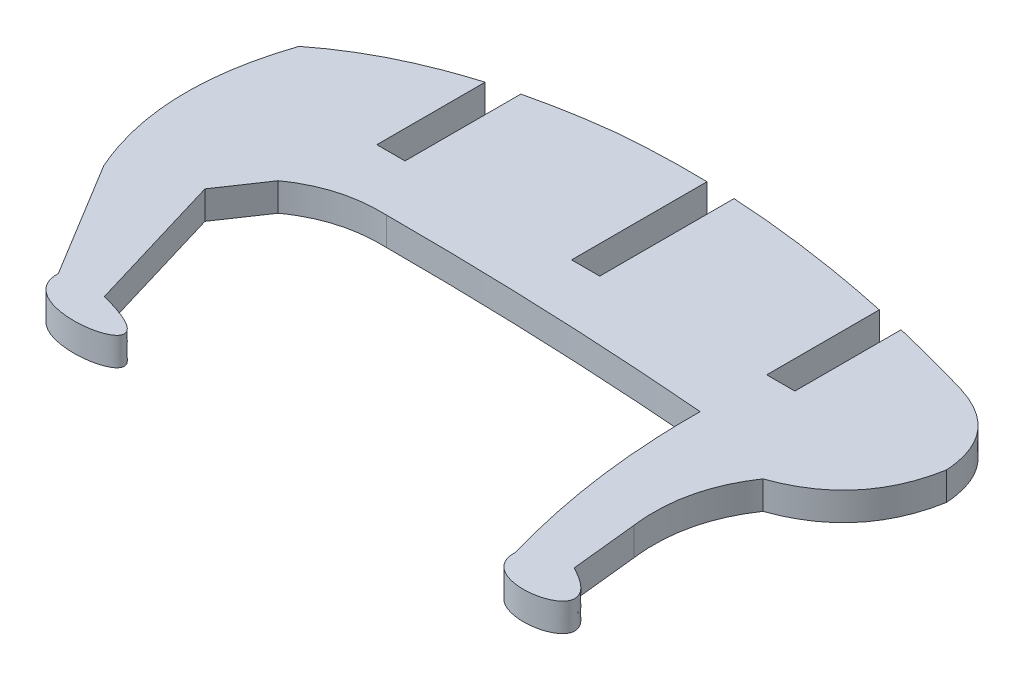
ISO-10303-21;
HEADER;
FILE_DESCRIPTION(('STEP AP214'),'2;1');
FILE_NAME('part.step','',(''),(''),'','','');
FILE_SCHEMA(('AUTOMOTIVE_DESIGN { 1 0 10303 214 1 1 1 1 }'));
ENDSEC;
DATA;
#1=APPLICATION_CONTEXT('core data for automotive mechanical design processes');
#2=APPLICATION_PROTOCOL_DEFINITION('international standard','automotive_design',2000,#1);
#3=PRODUCT_CONTEXT('',#1,'mechanical');
#4=PRODUCT('Part','Part','',(#3));
#5=PRODUCT_RELATED_PRODUCT_CATEGORY('part','',(#4));
#6=PRODUCT_DEFINITION_FORMATION('','',#4);
#7=PRODUCT_DEFINITION_CONTEXT('part definition',#1,'design');
#8=PRODUCT_DEFINITION('design','',#6,#7);
#9=PRODUCT_DEFINITION_SHAPE('','',#8);
#10=(LENGTH_UNIT() NAMED_UNIT(*) SI_UNIT(.MILLI.,.METRE.));
#11=(NAMED_UNIT(*) PLANE_ANGLE_UNIT() SI_UNIT($,.RADIAN.));
#12=(NAMED_UNIT(*) SI_UNIT($,.STERADIAN.) SOLID_ANGLE_UNIT());
#13=UNCERTAINTY_MEASURE_WITH_UNIT(LENGTH_MEASURE(1.E-05),#10,'distance_accuracy_value','');
#14=(GEOMETRIC_REPRESENTATION_CONTEXT(3) GLOBAL_UNCERTAINTY_ASSIGNED_CONTEXT((#13)) GLOBAL_UNIT_ASSIGNED_CONTEXT((#10,
#11,#12)) REPRESENTATION_CONTEXT('',''));
#15=CARTESIAN_POINT('',(0.,0.,0.));
#16=DIRECTION('',(0.,0.,1.));
#17=DIRECTION('',(1.,0.,0.));
#18=AXIS2_PLACEMENT_3D('',#15,#16,#17);
#19=CARTESIAN_POINT('',(48.337885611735,3.,-21.7938698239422));
#20=CARTESIAN_POINT('',(54.6502540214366,3.,-19.8548808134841));
#21=CARTESIAN_POINT('',(55.0566484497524,3.,-13.5654188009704));
#22=B_SPLINE_CURVE_WITH_KNOTS('',2,(#19,#20,#21),.UNSPECIFIED.,.F.,.F.,(3,3),(0.,1.),.UNSPECIFIED.);
#23=DIRECTION('',(0.,-1.,0.));
#24=VECTOR('',#23,1.);
#25=SURFACE_OF_LINEAR_EXTRUSION('',#22,#24);
#26=CARTESIAN_POINT('',(48.337885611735,0.,-21.7938698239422));
#27=CARTESIAN_POINT('',(54.6502540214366,0.,-19.8548808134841));
#28=CARTESIAN_POINT('',(55.0566484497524,0.,-13.5654188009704));
#29=B_SPLINE_CURVE_WITH_KNOTS('',2,(#26,#27,#28),.UNSPECIFIED.,.F.,.F.,(3,3),(0.,1.),.UNSPECIFIED.);
#30=CARTESIAN_POINT('',(48.337885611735,0.,-21.7938698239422));
#31=VERTEX_POINT('',#30);
#32=CARTESIAN_POINT('',(55.0566484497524,0.,-13.5654188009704));
#33=VERTEX_POINT('',#32);
#34=EDGE_CURVE('E254',#31,#33,#29,.T.);
#35=ORIENTED_EDGE('',*,*,#34,.F.);
#36=DIRECTION('',(0.,-1.,0.));
#37=VECTOR('',#36,1.);
#38=CARTESIAN_POINT('',(48.337885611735,3.,-21.7938698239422));
#39=LINE('',#38,#37);
#40=CARTESIAN_POINT('',(48.337885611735,3.,-21.7938698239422));
#41=VERTEX_POINT('',#40);
#42=EDGE_CURVE('E11',#41,#31,#39,.T.);
#43=ORIENTED_EDGE('',*,*,#42,.F.);
#44=CARTESIAN_POINT('',(55.0566484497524,3.,-13.5654188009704));
#45=VERTEX_POINT('',#44);
#46=EDGE_CURVE('E420',#41,#45,#22,.T.);
#47=ORIENTED_EDGE('',*,*,#46,.T.);
#48=DIRECTION('',(0.,-1.,0.));
#49=VECTOR('',#48,1.);
#50=CARTESIAN_POINT('',(55.0566484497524,3.,-13.5654188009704));
#51=LINE('',#50,#49);
#52=EDGE_CURVE('E43',#45,#33,#51,.T.);
#53=ORIENTED_EDGE('',*,*,#52,.T.);
#54=EDGE_LOOP('',(#35,#43,#47,#53));
#55=FACE_BOUND('',#54,.T.);
#56=ADVANCED_FACE('F39',(#55),#25,.T.);
#57=CARTESIAN_POINT('',(39.7065995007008,3.,-24.0872112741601));
#58=CARTESIAN_POINT('',(43.9230674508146,3.,-23.089505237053));
#59=CARTESIAN_POINT('',(48.337885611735,3.,-21.7938698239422));
#60=B_SPLINE_CURVE_WITH_KNOTS('',2,(#57,#58,#59),.UNSPECIFIED.,.F.,.F.,(3,3),(0.888901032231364,
1.),.UNSPECIFIED.);
#61=DIRECTION('',(0.,-1.,0.));
#62=VECTOR('',#61,1.);
#63=SURFACE_OF_LINEAR_EXTRUSION('',#60,#62);
#64=CARTESIAN_POINT('',(39.7065995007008,0.,-24.0872112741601));
#65=CARTESIAN_POINT('',(43.9230674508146,0.,-23.089505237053));
#66=CARTESIAN_POINT('',(48.337885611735,0.,-21.7938698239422));
#67=B_SPLINE_CURVE_WITH_KNOTS('',2,(#64,#65,#66),.UNSPECIFIED.,.F.,.F.,(3,3),(0.888901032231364,
1.),.UNSPECIFIED.);
#68=CARTESIAN_POINT('',(39.7065995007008,0.,-24.0872112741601));
#69=VERTEX_POINT('',#68);
#70=EDGE_CURVE('E427',#69,#31,#67,.T.);
#71=ORIENTED_EDGE('',*,*,#70,.F.);
#72=DIRECTION('',(0.,-1.,0.));
#73=VECTOR('',#72,1.);
#74=CARTESIAN_POINT('',(39.7065995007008,3.,-24.0872112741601));
#75=LINE('',#74,#73);
#76=CARTESIAN_POINT('',(39.7065995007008,3.,-24.0872112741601));
#77=VERTEX_POINT('',#76);
#78=EDGE_CURVE('E49',#77,#69,#75,.T.);
#79=ORIENTED_EDGE('',*,*,#78,.F.);
#80=EDGE_CURVE('E233',#77,#41,#60,.T.);
#81=ORIENTED_EDGE('',*,*,#80,.T.);
#82=ORIENTED_EDGE('',*,*,#42,.T.);
#83=EDGE_LOOP('',(#71,#79,#81,#82));
#84=FACE_BOUND('',#83,.T.);
#85=ADVANCED_FACE('F262',(#84),#63,.T.);
#86=CARTESIAN_POINT('',(39.7065995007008,3.,-24.0872112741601));
#87=DIRECTION('',(1.,0.,0.));
#88=DIRECTION('',(0.,0.,-1.));
#89=AXIS2_PLACEMENT_3D('',#86,#87,#88);
#90=PLANE('',#89);
#91=DIRECTION('',(0.,0.,1.));
#92=VECTOR('',#91,1.);
#93=CARTESIAN_POINT('',(39.7065995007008,0.,-24.0872112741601));
#94=LINE('',#93,#92);
#95=CARTESIAN_POINT('',(39.7065995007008,0.,-12.767457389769));
#96=VERTEX_POINT('',#95);
#97=EDGE_CURVE('E237',#69,#96,#94,.T.);
#98=ORIENTED_EDGE('',*,*,#97,.T.);
#99=DIRECTION('',(0.,-1.,0.));
#100=VECTOR('',#99,1.);
#101=CARTESIAN_POINT('',(39.7065995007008,3.,-12.767457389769));
#102=LINE('',#101,#100);
#103=CARTESIAN_POINT('',(39.7065995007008,3.,-12.767457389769));
#104=VERTEX_POINT('',#103);
#105=EDGE_CURVE('E235',#104,#96,#102,.T.);
#106=ORIENTED_EDGE('',*,*,#105,.F.);
#107=DIRECTION('',(0.,0.,1.));
#108=VECTOR('',#107,1.);
#109=CARTESIAN_POINT('',(39.7065995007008,3.,-24.0872112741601));
#110=LINE('',#109,#108);
#111=EDGE_CURVE('E226',#77,#104,#110,.T.);
#112=ORIENTED_EDGE('',*,*,#111,.F.);
#113=ORIENTED_EDGE('',*,*,#78,.T.);
#114=EDGE_LOOP('',(#98,#106,#112,#113));
#115=FACE_BOUND('',#114,.T.);
#116=ADVANCED_FACE('F236',(#115),#90,.F.);
#117=CARTESIAN_POINT('',(36.7065995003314,3.,-12.767457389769));
#118=DIRECTION('',(0.,0.,-1.));
#119=DIRECTION('',(-1.,0.,0.));
#120=AXIS2_PLACEMENT_3D('',#117,#118,#119);
#121=PLANE('',#120);
#122=DIRECTION('',(1.,0.,0.));
#123=VECTOR('',#122,1.);
#124=CARTESIAN_POINT('',(36.7065995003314,0.,-12.767457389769));
#125=LINE('',#124,#123);
#126=CARTESIAN_POINT('',(36.7065995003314,0.,-12.767457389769));
#127=VERTEX_POINT('',#126);
#128=EDGE_CURVE('E430',#127,#96,#125,.T.);
#129=ORIENTED_EDGE('',*,*,#128,.F.);
#130=DIRECTION('',(0.,-1.,0.));
#131=VECTOR('',#130,1.);
#132=CARTESIAN_POINT('',(36.7065995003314,3.,-12.767457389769));
#133=LINE('',#132,#131);
#134=CARTESIAN_POINT('',(36.7065995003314,3.,-12.767457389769));
#135=VERTEX_POINT('',#134);
#136=EDGE_CURVE('E241',#135,#127,#133,.T.);
#137=ORIENTED_EDGE('',*,*,#136,.F.);
#138=DIRECTION('',(1.,0.,0.));
#139=VECTOR('',#138,1.);
#140=CARTESIAN_POINT('',(36.7065995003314,3.,-12.767457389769));
#141=LINE('',#140,#139);
#142=EDGE_CURVE('E231',#135,#104,#141,.T.);
#143=ORIENTED_EDGE('',*,*,#142,.T.);
#144=ORIENTED_EDGE('',*,*,#105,.T.);
#145=EDGE_LOOP('',(#129,#137,#143,#144));
#146=FACE_BOUND('',#145,.T.);
#147=ADVANCED_FACE('F243',(#146),#121,.T.);
#148=CARTESIAN_POINT('',(36.7065995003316,3.,-24.7647669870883));
#149=DIRECTION('',(1.,0.,0.));
#150=DIRECTION('',(0.,0.,-1.));
#151=AXIS2_PLACEMENT_3D('',#148,#149,#150);
#152=PLANE('',#151);
#153=DIRECTION('',(0.,0.,1.));
#154=VECTOR('',#153,1.);
#155=CARTESIAN_POINT('',(36.7065995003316,0.,-24.7647669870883));
#156=LINE('',#155,#154);
#157=CARTESIAN_POINT('',(36.7065995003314,0.,-24.7647669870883));
#158=VERTEX_POINT('',#157);
#159=EDGE_CURVE('E472',#158,#127,#156,.T.);
#160=ORIENTED_EDGE('',*,*,#159,.F.);
#161=DIRECTION('',(0.,-1.,0.));
#162=VECTOR('',#161,1.);
#163=CARTESIAN_POINT('',(36.7065995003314,3.,-24.7647669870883));
#164=LINE('',#163,#162);
#165=CARTESIAN_POINT('',(36.7065995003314,3.,-24.7647669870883));
#166=VERTEX_POINT('',#165);
#167=EDGE_CURVE('E441',#166,#158,#164,.T.);
#168=ORIENTED_EDGE('',*,*,#167,.F.);
#169=DIRECTION('',(0.,0.,1.));
#170=VECTOR('',#169,1.);
#171=CARTESIAN_POINT('',(36.7065995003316,3.,-24.7647669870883));
#172=LINE('',#171,#170);
#173=EDGE_CURVE('E244',#166,#135,#172,.T.);
#174=ORIENTED_EDGE('',*,*,#173,.T.);
#175=ORIENTED_EDGE('',*,*,#136,.T.);
#176=EDGE_LOOP('',(#160,#168,#174,#175));
#177=FACE_BOUND('',#176,.T.);
#178=ADVANCED_FACE('F272',(#177),#152,.T.);
#179=CARTESIAN_POINT('',(18.7065995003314,3.,-27.285407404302));
#180=CARTESIAN_POINT('',(24.3576299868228,3.,-26.969359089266));
#181=CARTESIAN_POINT('',(30.3576299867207,3.,-26.1291456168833));
#182=CARTESIAN_POINT('',(36.7065995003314,3.,-24.7647669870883));
#183=B_SPLINE_CURVE_WITH_KNOTS('',3,(#179,#180,#181,#182),.UNSPECIFIED.,.F.,.F.,(4,4),
(0.593801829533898,0.849041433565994),.UNSPECIFIED.);
#184=DIRECTION('',(0.,-1.,0.));
#185=VECTOR('',#184,1.);
#186=SURFACE_OF_LINEAR_EXTRUSION('',#183,#185);
#187=CARTESIAN_POINT('',(18.7065995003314,0.,-27.285407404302));
#188=CARTESIAN_POINT('',(24.3576299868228,0.,-26.969359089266));
#189=CARTESIAN_POINT('',(30.3576299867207,0.,-26.1291456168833));
#190=CARTESIAN_POINT('',(36.7065995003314,0.,-24.7647669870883));
#191=B_SPLINE_CURVE_WITH_KNOTS('',3,(#187,#188,#189,#190),.UNSPECIFIED.,.F.,.F.,(4,4),
(0.593801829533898,0.849041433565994),.UNSPECIFIED.);
#192=CARTESIAN_POINT('',(18.7065995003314,0.,-27.285407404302));
#193=VERTEX_POINT('',#192);
#194=EDGE_CURVE('E467',#193,#158,#191,.T.);
#195=ORIENTED_EDGE('',*,*,#194,.F.);
#196=DIRECTION('',(0.,-1.,0.));
#197=VECTOR('',#196,1.);
#198=CARTESIAN_POINT('',(18.7065995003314,3.,-27.285407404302));
#199=LINE('',#198,#197);
#200=CARTESIAN_POINT('',(18.7065995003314,3.,-27.285407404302));
#201=VERTEX_POINT('',#200);
#202=EDGE_CURVE('E443',#201,#193,#199,.T.);
#203=ORIENTED_EDGE('',*,*,#202,.F.);
#204=EDGE_CURVE('E246',#201,#166,#183,.T.);
#205=ORIENTED_EDGE('',*,*,#204,.T.);
#206=ORIENTED_EDGE('',*,*,#167,.T.);
#207=EDGE_LOOP('',(#195,#203,#205,#206));
#208=FACE_BOUND('',#207,.T.);
#209=ADVANCED_FACE('F275',(#208),#186,.T.);
#210=CARTESIAN_POINT('',(18.7065995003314,3.,-27.285407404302));
#211=DIRECTION('',(1.,0.,0.));
#212=DIRECTION('',(0.,0.,-1.));
#213=AXIS2_PLACEMENT_3D('',#210,#211,#212);
#214=PLANE('',#213);
#215=DIRECTION('',(0.,0.,1.));
#216=VECTOR('',#215,1.);
#217=CARTESIAN_POINT('',(18.7065995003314,0.,-27.285407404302));
#218=LINE('',#217,#216);
#219=CARTESIAN_POINT('',(18.7065995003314,0.,-12.978867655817));
#220=VERTEX_POINT('',#219);
#221=EDGE_CURVE('E457',#193,#220,#218,.T.);
#222=ORIENTED_EDGE('',*,*,#221,.T.);
#223=DIRECTION('',(0.,-1.,0.));
#224=VECTOR('',#223,1.);
#225=CARTESIAN_POINT('',(18.7065995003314,3.,-12.978867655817));
#226=LINE('',#225,#224);
#227=CARTESIAN_POINT('',(18.7065995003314,3.,-12.978867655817));
#228=VERTEX_POINT('',#227);
#229=EDGE_CURVE('E445',#228,#220,#226,.T.);
#230=ORIENTED_EDGE('',*,*,#229,.F.);
#231=DIRECTION('',(0.,0.,1.));
#232=VECTOR('',#231,1.);
#233=CARTESIAN_POINT('',(18.7065995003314,3.,-27.285407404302));
#234=LINE('',#233,#232);
#235=EDGE_CURVE('E287',#201,#228,#234,.T.);
#236=ORIENTED_EDGE('',*,*,#235,.F.);
#237=ORIENTED_EDGE('',*,*,#202,.T.);
#238=EDGE_LOOP('',(#222,#230,#236,#237));
#239=FACE_BOUND('',#238,.T.);
#240=ADVANCED_FACE('F279',(#239),#214,.F.);
#241=CARTESIAN_POINT('',(15.7065994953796,3.,-12.978867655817));
#242=DIRECTION('',(0.,0.,-1.));
#243=DIRECTION('',(-1.,0.,0.));
#244=AXIS2_PLACEMENT_3D('',#241,#242,#243);
#245=PLANE('',#244);
#246=DIRECTION('',(1.,0.,0.));
#247=VECTOR('',#246,1.);
#248=CARTESIAN_POINT('',(15.7065994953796,0.,-12.978867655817));
#249=LINE('',#248,#247);
#250=CARTESIAN_POINT('',(15.7065994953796,0.,-12.978867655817));
#251=VERTEX_POINT('',#250);
#252=EDGE_CURVE('E452',#251,#220,#249,.T.);
#253=ORIENTED_EDGE('',*,*,#252,.F.);
#254=DIRECTION('',(0.,-1.,0.));
#255=VECTOR('',#254,1.);
#256=CARTESIAN_POINT('',(15.7065994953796,3.,-12.978867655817));
#257=LINE('',#256,#255);
#258=CARTESIAN_POINT('',(15.7065994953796,3.,-12.978867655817));
#259=VERTEX_POINT('',#258);
#260=EDGE_CURVE('E381',#259,#251,#257,.T.);
#261=ORIENTED_EDGE('',*,*,#260,.F.);
#262=DIRECTION('',(1.,0.,0.));
#263=VECTOR('',#262,1.);
#264=CARTESIAN_POINT('',(15.7065994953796,3.,-12.978867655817));
#265=LINE('',#264,#263);
#266=EDGE_CURVE('E292',#259,#228,#265,.T.);
#267=ORIENTED_EDGE('',*,*,#266,.T.);
#268=ORIENTED_EDGE('',*,*,#229,.T.);
#269=EDGE_LOOP('',(#253,#261,#267,#268));
#270=FACE_BOUND('',#269,.T.);
#271=ADVANCED_FACE('F453',(#270),#245,.T.);
#272=CARTESIAN_POINT('',(15.7065994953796,3.,-27.4047164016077));
#273=DIRECTION('',(1.,0.,0.));
#274=DIRECTION('',(0.,0.,-1.));
#275=AXIS2_PLACEMENT_3D('',#272,#273,#274);
#276=PLANE('',#275);
#277=DIRECTION('',(0.,0.,1.));
#278=VECTOR('',#277,1.);
#279=CARTESIAN_POINT('',(15.7065994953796,0.,-27.4047164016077));
#280=LINE('',#279,#278);
#281=CARTESIAN_POINT('',(15.7065994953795,0.,-27.4047164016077));
#282=VERTEX_POINT('',#281);
#283=EDGE_CURVE('E449',#282,#251,#280,.T.);
#284=ORIENTED_EDGE('',*,*,#283,.F.);
#285=DIRECTION('',(0.,-1.,0.));
#286=VECTOR('',#285,1.);
#287=CARTESIAN_POINT('',(15.7065994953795,3.,-27.4047164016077));
#288=LINE('',#287,#286);
#289=CARTESIAN_POINT('',(15.7065994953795,3.,-27.4047164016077));
#290=VERTEX_POINT('',#289);
#291=EDGE_CURVE('E375',#290,#282,#288,.T.);
#292=ORIENTED_EDGE('',*,*,#291,.F.);
#293=DIRECTION('',(0.,0.,1.));
#294=VECTOR('',#293,1.);
#295=CARTESIAN_POINT('',(15.7065994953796,3.,-27.4047164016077));
#296=LINE('',#295,#294);
#297=EDGE_CURVE('E295',#290,#259,#296,.T.);
#298=ORIENTED_EDGE('',*,*,#297,.T.);
#299=ORIENTED_EDGE('',*,*,#260,.T.);
#300=EDGE_LOOP('',(#284,#292,#298,#299));
#301=FACE_BOUND('',#300,.T.);
#302=ADVANCED_FACE('F318',(#301),#276,.T.);
#303=CARTESIAN_POINT('',(6.23728601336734,3.,-27.0796653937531));
#304=CARTESIAN_POINT('',(9.2708349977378,3.,-27.3725993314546));
#305=CARTESIAN_POINT('',(12.4272728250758,3.,-27.4809496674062));
#306=CARTESIAN_POINT('',(15.7065994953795,3.,-27.4047164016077));
#307=B_SPLINE_CURVE_WITH_KNOTS('',3,(#303,#304,#305,#306),.UNSPECIFIED.,.F.,.F.,(4,4),
(0.396665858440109,0.548130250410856),.UNSPECIFIED.);
#308=DIRECTION('',(0.,-1.,0.));
#309=VECTOR('',#308,1.);
#310=SURFACE_OF_LINEAR_EXTRUSION('',#307,#309);
#311=CARTESIAN_POINT('',(6.23728601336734,0.,-27.0796653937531));
#312=CARTESIAN_POINT('',(9.2708349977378,0.,-27.3725993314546));
#313=CARTESIAN_POINT('',(12.4272728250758,0.,-27.4809496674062));
#314=CARTESIAN_POINT('',(15.7065994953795,0.,-27.4047164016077));
#315=B_SPLINE_CURVE_WITH_KNOTS('',3,(#311,#312,#313,#314),.UNSPECIFIED.,.F.,.F.,(4,4),
(0.396665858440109,0.548130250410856),.UNSPECIFIED.);
#316=CARTESIAN_POINT('',(6.23728601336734,0.,-27.0796653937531));
#317=VERTEX_POINT('',#316);
#318=EDGE_CURVE('E378',#317,#282,#315,.T.);
#319=ORIENTED_EDGE('',*,*,#318,.F.);
#320=DIRECTION('',(0.,-1.,0.));
#321=VECTOR('',#320,1.);
#322=CARTESIAN_POINT('',(6.23728601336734,3.,-27.0796653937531));
#323=LINE('',#322,#321);
#324=CARTESIAN_POINT('',(6.23728601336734,3.,-27.0796653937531));
#325=VERTEX_POINT('',#324);
#326=EDGE_CURVE('E369',#325,#317,#323,.T.);
#327=ORIENTED_EDGE('',*,*,#326,.F.);
#328=EDGE_CURVE('E298',#325,#290,#307,.T.);
#329=ORIENTED_EDGE('',*,*,#328,.T.);
#330=ORIENTED_EDGE('',*,*,#291,.T.);
#331=EDGE_LOOP('',(#319,#327,#329,#330));
#332=FACE_BOUND('',#331,.T.);
#333=ADVANCED_FACE('F313',(#332),#310,.T.);
#334=CARTESIAN_POINT('',(-2.29340050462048,3.,-25.5718308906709));
#335=CARTESIAN_POINT('',(1.93618210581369,3.,-26.5898860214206));
#336=CARTESIAN_POINT('',(6.23728601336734,3.,-27.0796653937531));
#337=B_SPLINE_CURVE_WITH_KNOTS('',2,(#334,#335,#336),.UNSPECIFIED.,.F.,.F.,(3,3),
(0.783562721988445,1.),.UNSPECIFIED.);
#338=DIRECTION('',(0.,-1.,0.));
#339=VECTOR('',#338,1.);
#340=SURFACE_OF_LINEAR_EXTRUSION('',#337,#339);
#341=CARTESIAN_POINT('',(-2.29340050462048,0.,-25.5718308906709));
#342=CARTESIAN_POINT('',(1.93618210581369,0.,-26.5898860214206));
#343=CARTESIAN_POINT('',(6.23728601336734,0.,-27.0796653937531));
#344=B_SPLINE_CURVE_WITH_KNOTS('',2,(#341,#342,#343),.UNSPECIFIED.,.F.,.F.,(3,3),
(0.783562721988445,1.),.UNSPECIFIED.);
#345=CARTESIAN_POINT('',(-2.29340050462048,0.,-25.5718308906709));
#346=VERTEX_POINT('',#345);
#347=EDGE_CURVE('E460',#346,#317,#344,.T.);
#348=ORIENTED_EDGE('',*,*,#347,.F.);
#349=DIRECTION('',(0.,-1.,0.));
#350=VECTOR('',#349,1.);
#351=CARTESIAN_POINT('',(-2.29340050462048,3.,-25.5718308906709));
#352=LINE('',#351,#350);
#353=CARTESIAN_POINT('',(-2.29340050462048,3.,-25.5718308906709));
#354=VERTEX_POINT('',#353);
#355=EDGE_CURVE('E371',#354,#346,#352,.T.);
#356=ORIENTED_EDGE('',*,*,#355,.F.);
#357=EDGE_CURVE('E304',#354,#325,#337,.T.);
#358=ORIENTED_EDGE('',*,*,#357,.T.);
#359=ORIENTED_EDGE('',*,*,#326,.T.);
#360=EDGE_LOOP('',(#348,#356,#358,#359));
#361=FACE_BOUND('',#360,.T.);
#362=ADVANCED_FACE('F317',(#361),#340,.T.);
#363=CARTESIAN_POINT('',(-2.29340050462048,3.,-25.5718308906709));
#364=DIRECTION('',(1.,0.,0.));
#365=DIRECTION('',(0.,0.,-1.));
#366=AXIS2_PLACEMENT_3D('',#363,#364,#365);
#367=PLANE('',#366);
#368=DIRECTION('',(0.,0.,1.));
#369=VECTOR('',#368,1.);
#370=CARTESIAN_POINT('',(-2.29340050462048,0.,-25.5718308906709));
#371=LINE('',#370,#369);
#372=CARTESIAN_POINT('',(-2.29340050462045,0.,-13.2320208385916));
#373=VERTEX_POINT('',#372);
#374=EDGE_CURVE('E895',#346,#373,#371,.T.);
#375=ORIENTED_EDGE('',*,*,#374,.T.);
#376=DIRECTION('',(0.,-1.,0.));
#377=VECTOR('',#376,1.);
#378=CARTESIAN_POINT('',(-2.29340050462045,3.,-13.2320208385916));
#379=LINE('',#378,#377);
#380=CARTESIAN_POINT('',(-2.29340050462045,3.,-13.2320208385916));
#381=VERTEX_POINT('',#380);
#382=EDGE_CURVE('E383',#381,#373,#379,.T.);
#383=ORIENTED_EDGE('',*,*,#382,.F.);
#384=DIRECTION('',(0.,0.,1.));
#385=VECTOR('',#384,1.);
#386=CARTESIAN_POINT('',(-2.29340050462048,3.,-25.5718308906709));
#387=LINE('',#386,#385);
#388=EDGE_CURVE('E362',#354,#381,#387,.T.);
#389=ORIENTED_EDGE('',*,*,#388,.F.);
#390=ORIENTED_EDGE('',*,*,#355,.T.);
#391=EDGE_LOOP('',(#375,#383,#389,#390));
#392=FACE_BOUND('',#391,.T.);
#393=ADVANCED_FACE('F322',(#392),#367,.F.);
#394=CARTESIAN_POINT('',(-5.29340051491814,3.,-13.2320208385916));
#395=DIRECTION('',(0.,0.,-1.));
#396=DIRECTION('',(-1.,0.,0.));
#397=AXIS2_PLACEMENT_3D('',#394,#395,#396);
#398=PLANE('',#397);
#399=DIRECTION('',(1.,0.,0.));
#400=VECTOR('',#399,1.);
#401=CARTESIAN_POINT('',(-5.29340051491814,0.,-13.2320208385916));
#402=LINE('',#401,#400);
#403=CARTESIAN_POINT('',(-5.29340051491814,0.,-13.2320208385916));
#404=VERTEX_POINT('',#403);
#405=EDGE_CURVE('E892',#404,#373,#402,.T.);
#406=ORIENTED_EDGE('',*,*,#405,.F.);
#407=DIRECTION('',(0.,-1.,0.));
#408=VECTOR('',#407,1.);
#409=CARTESIAN_POINT('',(-5.29340051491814,3.,-13.2320208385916));
#410=LINE('',#409,#408);
#411=CARTESIAN_POINT('',(-5.29340051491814,3.,-13.2320208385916));
#412=VERTEX_POINT('',#411);
#413=EDGE_CURVE('E388',#412,#404,#410,.T.);
#414=ORIENTED_EDGE('',*,*,#413,.F.);
#415=DIRECTION('',(1.,0.,0.));
#416=VECTOR('',#415,1.);
#417=CARTESIAN_POINT('',(-5.29340051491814,3.,-13.2320208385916));
#418=LINE('',#417,#416);
#419=EDGE_CURVE('E360',#412,#381,#418,.T.);
#420=ORIENTED_EDGE('',*,*,#419,.T.);
#421=ORIENTED_EDGE('',*,*,#382,.T.);
#422=EDGE_LOOP('',(#406,#414,#420,#421));
#423=FACE_BOUND('',#422,.T.);
#424=ADVANCED_FACE('F326',(#423),#398,.T.);
#425=CARTESIAN_POINT('',(-5.29340051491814,3.,-24.765059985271));
#426=DIRECTION('',(1.,0.,0.));
#427=DIRECTION('',(0.,0.,-1.));
#428=AXIS2_PLACEMENT_3D('',#425,#426,#427);
#429=PLANE('',#428);
#430=DIRECTION('',(0.,0.,1.));
#431=VECTOR('',#430,1.);
#432=CARTESIAN_POINT('',(-5.29340051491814,0.,-24.765059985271));
#433=LINE('',#432,#431);
#434=CARTESIAN_POINT('',(-5.29340051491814,0.,-24.765059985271));
#435=VERTEX_POINT('',#434);
#436=EDGE_CURVE('E886',#435,#404,#433,.T.);
#437=ORIENTED_EDGE('',*,*,#436,.F.);
#438=DIRECTION('',(0.,-1.,0.));
#439=VECTOR('',#438,1.);
#440=CARTESIAN_POINT('',(-5.29340051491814,3.,-24.765059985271));
#441=LINE('',#440,#439);
#442=CARTESIAN_POINT('',(-5.29340051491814,3.,-24.765059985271));
#443=VERTEX_POINT('',#442);
#444=EDGE_CURVE('E390',#443,#435,#441,.T.);
#445=ORIENTED_EDGE('',*,*,#444,.F.);
#446=DIRECTION('',(0.,0.,1.));
#447=VECTOR('',#446,1.);
#448=CARTESIAN_POINT('',(-5.29340051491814,3.,-24.765059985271));
#449=LINE('',#448,#447);
#450=EDGE_CURVE('E349',#443,#412,#449,.T.);
#451=ORIENTED_EDGE('',*,*,#450,.T.);
#452=ORIENTED_EDGE('',*,*,#413,.T.);
#453=EDGE_LOOP('',(#437,#445,#451,#452));
#454=FACE_BOUND('',#453,.T.);
#455=ADVANCED_FACE('F330',(#454),#429,.T.);
#456=CARTESIAN_POINT('',(-18.5169229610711,3.,-18.1507684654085));
#457=CARTESIAN_POINT('',(-16.029368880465,3.,-20.1251601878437));
#458=CARTESIAN_POINT('',(-11.7184028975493,3.,-22.5792570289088));
#459=CARTESIAN_POINT('',(-7.02427865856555,3.,-24.2475556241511));
#460=CARTESIAN_POINT('',(-5.29340051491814,3.,-24.765059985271));
#461=B_SPLINE_CURVE_WITH_KNOTS('',3,(#456,#457,#458,#459,#460),.UNSPECIFIED.,.F.,.F.,(4,1,4),
(0.333246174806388,0.571137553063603,0.706215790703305),.UNSPECIFIED.);
#462=DIRECTION('',(0.,-1.,0.));
#463=VECTOR('',#462,1.);
#464=SURFACE_OF_LINEAR_EXTRUSION('',#461,#463);
#465=CARTESIAN_POINT('',(-18.5169229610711,0.,-18.1507684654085));
#466=CARTESIAN_POINT('',(-16.029368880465,0.,-20.1251601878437));
#467=CARTESIAN_POINT('',(-11.7184028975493,0.,-22.5792570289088));
#468=CARTESIAN_POINT('',(-7.02427865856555,0.,-24.2475556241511));
#469=CARTESIAN_POINT('',(-5.29340051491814,0.,-24.765059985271));
#470=B_SPLINE_CURVE_WITH_KNOTS('',3,(#465,#466,#467,#468,#469),.UNSPECIFIED.,.F.,.F.,(4,1,4),
(0.333246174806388,0.571137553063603,0.706215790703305),.UNSPECIFIED.);
#471=CARTESIAN_POINT('',(-18.5169229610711,0.,-18.1507684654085));
#472=VERTEX_POINT('',#471);
#473=EDGE_CURVE('E878',#472,#435,#470,.T.);
#474=ORIENTED_EDGE('',*,*,#473,.F.);
#475=DIRECTION('',(0.,-1.,0.));
#476=VECTOR('',#475,1.);
#477=CARTESIAN_POINT('',(-18.5169229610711,3.,-18.1507684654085));
#478=LINE('',#477,#476);
#479=CARTESIAN_POINT('',(-18.5169229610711,3.,-18.1507684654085));
#480=VERTEX_POINT('',#479);
#481=EDGE_CURVE('E392',#480,#472,#478,.T.);
#482=ORIENTED_EDGE('',*,*,#481,.F.);
#483=EDGE_CURVE('E343',#480,#443,#461,.T.);
#484=ORIENTED_EDGE('',*,*,#483,.T.);
#485=ORIENTED_EDGE('',*,*,#444,.T.);
#486=EDGE_LOOP('',(#474,#482,#484,#485));
#487=FACE_BOUND('',#486,.T.);
#488=ADVANCED_FACE('F334',(#487),#464,.T.);
#489=CARTESIAN_POINT('',(-18.5169229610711,3.,-18.1507684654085));
#490=CARTESIAN_POINT('',(-22.3382391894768,3.,-6.7805902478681));
#491=CARTESIAN_POINT('',(-17.907658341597,3.,3.24395230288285));
#492=B_SPLINE_CURVE_WITH_KNOTS('',2,(#489,#490,#491),.UNSPECIFIED.,.F.,.F.,(3,3),(0.,1.),.UNSPECIFIED.);
#493=DIRECTION('',(0.,-1.,0.));
#494=VECTOR('',#493,1.);
#495=SURFACE_OF_LINEAR_EXTRUSION('',#492,#494);
#496=CARTESIAN_POINT('',(-18.5169229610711,0.,-18.1507684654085));
#497=CARTESIAN_POINT('',(-22.3382391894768,0.,-6.7805902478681));
#498=CARTESIAN_POINT('',(-17.907658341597,0.,3.24395230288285));
#499=B_SPLINE_CURVE_WITH_KNOTS('',2,(#496,#497,#498),.UNSPECIFIED.,.F.,.F.,(3,3),(0.,1.),.UNSPECIFIED.);
#500=CARTESIAN_POINT('',(-17.907658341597,0.,3.24395230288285));
#501=VERTEX_POINT('',#500);
#502=EDGE_CURVE('E784',#472,#501,#499,.T.);
#503=ORIENTED_EDGE('',*,*,#502,.T.);
#504=DIRECTION('',(0.,-1.,0.));
#505=VECTOR('',#504,1.);
#506=CARTESIAN_POINT('',(-17.907658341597,3.,3.24395230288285));
#507=LINE('',#506,#505);
#508=CARTESIAN_POINT('',(-17.907658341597,3.,3.24395230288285));
#509=VERTEX_POINT('',#508);
#510=EDGE_CURVE('E394',#509,#501,#507,.T.);
#511=ORIENTED_EDGE('',*,*,#510,.F.);
#512=EDGE_CURVE('E350',#480,#509,#492,.T.);
#513=ORIENTED_EDGE('',*,*,#512,.F.);
#514=ORIENTED_EDGE('',*,*,#481,.T.);
#515=EDGE_LOOP('',(#503,#511,#513,#514));
#516=FACE_BOUND('',#515,.T.);
#517=ADVANCED_FACE('F339',(#516),#495,.F.);
#518=CARTESIAN_POINT('',(-17.907658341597,3.,3.24395230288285));
#519=DIRECTION('',(0.854145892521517,0.,-0.520033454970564));
#520=DIRECTION('',(-0.520033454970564,0.,-0.854145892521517));
#521=AXIS2_PLACEMENT_3D('',#518,#519,#520);
#522=PLANE('',#521);
#523=CARTESIAN_POINT('',(-17.907658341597,0.,3.24395230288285));
#524=CARTESIAN_POINT('',(-10.3741587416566,0.,15.6175941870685));
#525=B_SPLINE_CURVE_WITH_KNOTS('',1,(#523,#524),.UNSPECIFIED.,.F.,.F.,(2,2),(0.,1.),.UNSPECIFIED.);
#526=CARTESIAN_POINT('',(-10.3741587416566,0.,15.6175941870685));
#527=VERTEX_POINT('',#526);
#528=EDGE_CURVE('E787',#501,#527,#525,.T.);
#529=ORIENTED_EDGE('',*,*,#528,.T.);
#530=DIRECTION('',(0.,-1.,0.));
#531=VECTOR('',#530,1.);
#532=CARTESIAN_POINT('',(-10.3741587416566,3.,15.6175941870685));
#533=LINE('',#532,#531);
#534=CARTESIAN_POINT('',(-10.3741587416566,3.,15.6175941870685));
#535=VERTEX_POINT('',#534);
#536=EDGE_CURVE('E397',#535,#527,#533,.T.);
#537=ORIENTED_EDGE('',*,*,#536,.F.);
#538=CARTESIAN_POINT('',(-17.907658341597,3.,3.24395230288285));
#539=CARTESIAN_POINT('',(-10.3741587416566,3.,15.6175941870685));
#540=B_SPLINE_CURVE_WITH_KNOTS('',1,(#538,#539),.UNSPECIFIED.,.F.,.F.,(2,2),(0.,1.),.UNSPECIFIED.);
#541=EDGE_CURVE('E768',#509,#535,#540,.T.);
#542=ORIENTED_EDGE('',*,*,#541,.F.);
#543=ORIENTED_EDGE('',*,*,#510,.T.);
#544=EDGE_LOOP('',(#529,#537,#542,#543));
#545=FACE_BOUND('',#544,.T.);
#546=ADVANCED_FACE('F577',(#545),#522,.F.);
#547=CARTESIAN_POINT('',(-10.3741587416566,3.,15.6175941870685));
#548=CARTESIAN_POINT('',(-10.5917911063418,3.,22.0077264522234));
#549=CARTESIAN_POINT('',(6.61277602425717,3.,18.3702014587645));
#550=CARTESIAN_POINT('',(-5.79342079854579,3.,15.3026521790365));
#551=B_SPLINE_CURVE_WITH_KNOTS('',3,(#547,#548,#549,#550),.UNSPECIFIED.,.F.,.F.,(4,4),(0.,1.),.UNSPECIFIED.);
#552=DIRECTION('',(0.,-1.,0.));
#553=VECTOR('',#552,1.);
#554=SURFACE_OF_LINEAR_EXTRUSION('',#551,#553);
#555=CARTESIAN_POINT('',(-10.3741587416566,0.,15.6175941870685));
#556=CARTESIAN_POINT('',(-10.5917911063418,0.,22.0077264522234));
#557=CARTESIAN_POINT('',(6.61277602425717,0.,18.3702014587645));
#558=CARTESIAN_POINT('',(-5.79342079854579,0.,15.3026521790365));
#559=B_SPLINE_CURVE_WITH_KNOTS('',3,(#555,#556,#557,#558),.UNSPECIFIED.,.F.,.F.,(4,4),(0.,1.),.UNSPECIFIED.);
#560=CARTESIAN_POINT('',(-5.79342079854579,0.,15.3026521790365));
#561=VERTEX_POINT('',#560);
#562=EDGE_CURVE('E859',#527,#561,#559,.T.);
#563=ORIENTED_EDGE('',*,*,#562,.T.);
#564=DIRECTION('',(0.,-1.,0.));
#565=VECTOR('',#564,1.);
#566=CARTESIAN_POINT('',(-5.79342079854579,3.,15.3026521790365));
#567=LINE('',#566,#565);
#568=CARTESIAN_POINT('',(-5.79342079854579,3.,15.3026521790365));
#569=VERTEX_POINT('',#568);
#570=EDGE_CURVE('E400',#569,#561,#567,.T.);
#571=ORIENTED_EDGE('',*,*,#570,.F.);
#572=EDGE_CURVE('E761',#535,#569,#551,.T.);
#573=ORIENTED_EDGE('',*,*,#572,.F.);
#574=ORIENTED_EDGE('',*,*,#536,.T.);
#575=EDGE_LOOP('',(#563,#571,#573,#574));
#576=FACE_BOUND('',#575,.T.);
#577=ADVANCED_FACE('F586',(#576),#554,.F.);
#578=CARTESIAN_POINT('',(-5.79342079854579,3.,15.3026521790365));
#579=DIRECTION('',(-0.957999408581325,0.,0.286770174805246));
#580=DIRECTION('',(0.286770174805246,0.,0.957999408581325));
#581=AXIS2_PLACEMENT_3D('',#578,#579,#580);
#582=PLANE('',#581);
#583=CARTESIAN_POINT('',(-5.79342079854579,0.,15.3026521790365));
#584=CARTESIAN_POINT('',(-10.3741587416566,0.,0.));
#585=B_SPLINE_CURVE_WITH_KNOTS('',1,(#583,#584),.UNSPECIFIED.,.F.,.F.,(2,2),(0.,1.),.UNSPECIFIED.);
#586=CARTESIAN_POINT('',(-10.3741587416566,0.,0.));
#587=VERTEX_POINT('',#586);
#588=EDGE_CURVE('E796',#561,#587,#585,.T.);
#589=ORIENTED_EDGE('',*,*,#588,.T.);
#590=DIRECTION('',(0.,-1.,0.));
#591=VECTOR('',#590,1.);
#592=CARTESIAN_POINT('',(-10.3741587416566,3.,0.));
#593=LINE('',#592,#591);
#594=CARTESIAN_POINT('',(-10.3741587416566,3.,0.));
#595=VERTEX_POINT('',#594);
#596=EDGE_CURVE('E403',#595,#587,#593,.T.);
#597=ORIENTED_EDGE('',*,*,#596,.F.);
#598=CARTESIAN_POINT('',(-5.79342079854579,3.,15.3026521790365));
#599=CARTESIAN_POINT('',(-10.3741587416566,3.,0.));
#600=B_SPLINE_CURVE_WITH_KNOTS('',1,(#598,#599),.UNSPECIFIED.,.F.,.F.,(2,2),(0.,1.),.UNSPECIFIED.);
#601=EDGE_CURVE('E757',#569,#595,#600,.T.);
#602=ORIENTED_EDGE('',*,*,#601,.F.);
#603=ORIENTED_EDGE('',*,*,#570,.T.);
#604=EDGE_LOOP('',(#589,#597,#602,#603));
#605=FACE_BOUND('',#604,.T.);
#606=ADVANCED_FACE('F595',(#605),#582,.F.);
#607=CARTESIAN_POINT('',(-7.23371668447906,3.,-4.64367499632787));
#608=DIRECTION('',(0.828355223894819,0.,0.560203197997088));
#609=DIRECTION('',(0.560203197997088,0.,-0.828355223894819));
#610=AXIS2_PLACEMENT_3D('',#607,#608,#609);
#611=PLANE('',#610);
#612=DIRECTION('',(-0.560203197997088,0.,0.828355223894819));
#613=VECTOR('',#612,1.);
#614=CARTESIAN_POINT('',(-7.23371668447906,0.,-4.64367499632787));
#615=LINE('',#614,#613);
#616=CARTESIAN_POINT('',(-7.23371668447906,0.,-4.64367499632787));
#617=VERTEX_POINT('',#616);
#618=EDGE_CURVE('E799',#617,#587,#615,.T.);
#619=ORIENTED_EDGE('',*,*,#618,.F.);
#620=DIRECTION('',(0.,-1.,0.));
#621=VECTOR('',#620,1.);
#622=CARTESIAN_POINT('',(-7.23371668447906,3.,-4.64367499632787));
#623=LINE('',#622,#621);
#624=CARTESIAN_POINT('',(-7.23371668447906,3.,-4.64367499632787));
#625=VERTEX_POINT('',#624);
#626=EDGE_CURVE('E405',#625,#617,#623,.T.);
#627=ORIENTED_EDGE('',*,*,#626,.F.);
#628=DIRECTION('',(-0.560203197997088,0.,0.828355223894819));
#629=VECTOR('',#628,1.);
#630=CARTESIAN_POINT('',(-7.23371668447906,3.,-4.64367499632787));
#631=LINE('',#630,#629);
#632=EDGE_CURVE('E751',#625,#595,#631,.T.);
#633=ORIENTED_EDGE('',*,*,#632,.T.);
#634=ORIENTED_EDGE('',*,*,#596,.T.);
#635=EDGE_LOOP('',(#619,#627,#633,#634));
#636=FACE_BOUND('',#635,.T.);
#637=ADVANCED_FACE('F605',(#636),#611,.T.);
#638=CARTESIAN_POINT('',(1.69446574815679,3.,-7.25441614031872));
#639=CARTESIAN_POINT('',(-3.38712802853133,3.,-7.43197826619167));
#640=CARTESIAN_POINT('',(-7.23371668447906,3.,-4.64367499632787));
#641=B_SPLINE_CURVE_WITH_KNOTS('',2,(#638,#639,#640),.UNSPECIFIED.,.F.,.F.,(3,3),(0.,1.),.UNSPECIFIED.);
#642=DIRECTION('',(0.,-1.,0.));
#643=VECTOR('',#642,1.);
#644=SURFACE_OF_LINEAR_EXTRUSION('',#641,#643);
#645=CARTESIAN_POINT('',(1.69446574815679,0.,-7.25441614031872));
#646=CARTESIAN_POINT('',(-3.38712802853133,0.,-7.43197826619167));
#647=CARTESIAN_POINT('',(-7.23371668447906,0.,-4.64367499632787));
#648=B_SPLINE_CURVE_WITH_KNOTS('',2,(#645,#646,#647),.UNSPECIFIED.,.F.,.F.,(3,3),(0.,1.),.UNSPECIFIED.);
#649=CARTESIAN_POINT('',(1.6944657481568,0.,-7.25441614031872));
#650=VERTEX_POINT('',#649);
#651=EDGE_CURVE('E802',#650,#617,#648,.T.);
#652=ORIENTED_EDGE('',*,*,#651,.F.);
#653=DIRECTION('',(0.,-1.,0.));
#654=VECTOR('',#653,1.);
#655=CARTESIAN_POINT('',(1.6944657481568,3.,-7.25441614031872));
#656=LINE('',#655,#654);
#657=CARTESIAN_POINT('',(1.6944657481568,3.,-7.25441614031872));
#658=VERTEX_POINT('',#657);
#659=EDGE_CURVE('E407',#658,#650,#656,.T.);
#660=ORIENTED_EDGE('',*,*,#659,.F.);
#661=EDGE_CURVE('E742',#658,#625,#641,.T.);
#662=ORIENTED_EDGE('',*,*,#661,.T.);
#663=ORIENTED_EDGE('',*,*,#626,.T.);
#664=EDGE_LOOP('',(#652,#660,#662,#663));
#665=FACE_BOUND('',#664,.T.);
#666=ADVANCED_FACE('F615',(#665),#644,.T.);
#667=CARTESIAN_POINT('',(36.5573555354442,3.,-5.82926713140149));
#668=CARTESIAN_POINT('',(24.9500591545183,3.,-6.78951828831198));
#669=CARTESIAN_POINT('',(13.3290958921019,3.,-7.26456795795));
#670=CARTESIAN_POINT('',(1.6944657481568,3.,-7.25441614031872));
#671=B_SPLINE_CURVE_WITH_KNOTS('',3,(#667,#668,#669,#670),.UNSPECIFIED.,.F.,.F.,(4,4),
(0.259120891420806,1.),.UNSPECIFIED.);
#672=DIRECTION('',(0.,-1.,0.));
#673=VECTOR('',#672,1.);
#674=SURFACE_OF_LINEAR_EXTRUSION('',#671,#673);
#675=CARTESIAN_POINT('',(36.5573555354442,0.,-5.82926713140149));
#676=CARTESIAN_POINT('',(24.9500591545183,0.,-6.78951828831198));
#677=CARTESIAN_POINT('',(13.3290958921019,0.,-7.26456795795));
#678=CARTESIAN_POINT('',(1.6944657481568,0.,-7.25441614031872));
#679=B_SPLINE_CURVE_WITH_KNOTS('',3,(#675,#676,#677,#678),.UNSPECIFIED.,.F.,.F.,(4,4),
(0.259120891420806,1.),.UNSPECIFIED.);
#680=CARTESIAN_POINT('',(36.5573555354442,0.,-5.82926713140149));
#681=VERTEX_POINT('',#680);
#682=EDGE_CURVE('E808',#681,#650,#679,.T.);
#683=ORIENTED_EDGE('',*,*,#682,.F.);
#684=DIRECTION('',(0.,-1.,0.));
#685=VECTOR('',#684,1.);
#686=CARTESIAN_POINT('',(36.5573555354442,3.,-5.82926713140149));
#687=LINE('',#686,#685);
#688=CARTESIAN_POINT('',(36.5573555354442,3.,-5.82926713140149));
#689=VERTEX_POINT('',#688);
#690=EDGE_CURVE('E409',#689,#681,#687,.T.);
#691=ORIENTED_EDGE('',*,*,#690,.F.);
#692=EDGE_CURVE('E737',#689,#658,#671,.T.);
#693=ORIENTED_EDGE('',*,*,#692,.T.);
#694=ORIENTED_EDGE('',*,*,#659,.T.);
#695=EDGE_LOOP('',(#683,#691,#693,#694));
#696=FACE_BOUND('',#695,.T.);
#697=ADVANCED_FACE('F625',(#696),#674,.T.);
#698=CARTESIAN_POINT('',(39.7065995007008,3.,16.9764440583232));
#699=CARTESIAN_POINT('',(36.4198459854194,3.,5.74581267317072));
#700=CARTESIAN_POINT('',(36.5573555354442,3.,-5.82926713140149));
#701=B_SPLINE_CURVE_WITH_KNOTS('',2,(#698,#699,#700),.UNSPECIFIED.,.F.,.F.,(3,3),(0.,1.),.UNSPECIFIED.);
#702=DIRECTION('',(0.,-1.,0.));
#703=VECTOR('',#702,1.);
#704=SURFACE_OF_LINEAR_EXTRUSION('',#701,#703);
#705=CARTESIAN_POINT('',(39.7065995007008,0.,16.9764440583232));
#706=CARTESIAN_POINT('',(36.4198459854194,0.,5.74581267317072));
#707=CARTESIAN_POINT('',(36.5573555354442,0.,-5.82926713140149));
#708=B_SPLINE_CURVE_WITH_KNOTS('',2,(#705,#706,#707),.UNSPECIFIED.,.F.,.F.,(3,3),(0.,1.),.UNSPECIFIED.);
#709=CARTESIAN_POINT('',(39.7065995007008,0.,16.9764440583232));
#710=VERTEX_POINT('',#709);
#711=EDGE_CURVE('E811',#710,#681,#708,.T.);
#712=ORIENTED_EDGE('',*,*,#711,.F.);
#713=DIRECTION('',(0.,-1.,0.));
#714=VECTOR('',#713,1.);
#715=CARTESIAN_POINT('',(39.7065995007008,3.,16.9764440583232));
#716=LINE('',#715,#714);
#717=CARTESIAN_POINT('',(39.7065995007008,3.,16.9764440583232));
#718=VERTEX_POINT('',#717);
#719=EDGE_CURVE('E411',#718,#710,#716,.T.);
#720=ORIENTED_EDGE('',*,*,#719,.F.);
#721=EDGE_CURVE('E728',#718,#689,#701,.T.);
#722=ORIENTED_EDGE('',*,*,#721,.T.);
#723=ORIENTED_EDGE('',*,*,#690,.T.);
#724=EDGE_LOOP('',(#712,#720,#722,#723));
#725=FACE_BOUND('',#724,.T.);
#726=ADVANCED_FACE('F635',(#725),#704,.T.);
#727=CARTESIAN_POINT('',(44.2660315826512,3.,15.3026521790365));
#728=CARTESIAN_POINT('',(52.8213485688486,3.,19.6284664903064));
#729=CARTESIAN_POINT('',(39.3853991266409,3.,22.4232881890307));
#730=CARTESIAN_POINT('',(39.7065995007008,3.,16.9764440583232));
#731=B_SPLINE_CURVE_WITH_KNOTS('',3,(#727,#728,#729,#730),.UNSPECIFIED.,.F.,.F.,(4,4),(0.,1.),.UNSPECIFIED.);
#732=DIRECTION('',(0.,-1.,0.));
#733=VECTOR('',#732,1.);
#734=SURFACE_OF_LINEAR_EXTRUSION('',#731,#733);
#735=CARTESIAN_POINT('',(44.2660315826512,0.,15.3026521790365));
#736=CARTESIAN_POINT('',(52.8213485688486,0.,19.6284664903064));
#737=CARTESIAN_POINT('',(39.3853991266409,0.,22.4232881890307));
#738=CARTESIAN_POINT('',(39.7065995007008,0.,16.9764440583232));
#739=B_SPLINE_CURVE_WITH_KNOTS('',3,(#735,#736,#737,#738),.UNSPECIFIED.,.F.,.F.,(4,4),(0.,1.),.UNSPECIFIED.);
#740=CARTESIAN_POINT('',(44.2660315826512,0.,15.3026521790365));
#741=VERTEX_POINT('',#740);
#742=EDGE_CURVE('E816',#741,#710,#739,.T.);
#743=ORIENTED_EDGE('',*,*,#742,.F.);
#744=DIRECTION('',(0.,-1.,0.));
#745=VECTOR('',#744,1.);
#746=CARTESIAN_POINT('',(44.2660315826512,3.,15.3026521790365));
#747=LINE('',#746,#745);
#748=CARTESIAN_POINT('',(44.2660315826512,3.,15.3026521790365));
#749=VERTEX_POINT('',#748);
#750=EDGE_CURVE('E413',#749,#741,#747,.T.);
#751=ORIENTED_EDGE('',*,*,#750,.F.);
#752=EDGE_CURVE('E722',#749,#718,#731,.T.);
#753=ORIENTED_EDGE('',*,*,#752,.T.);
#754=ORIENTED_EDGE('',*,*,#719,.T.);
#755=EDGE_LOOP('',(#743,#751,#753,#754));
#756=FACE_BOUND('',#755,.T.);
#757=ADVANCED_FACE('F645',(#756),#734,.T.);
#758=CARTESIAN_POINT('',(43.5158651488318,3.,8.18671558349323));
#759=DIRECTION('',(0.994489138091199,0.,-0.104839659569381));
#760=DIRECTION('',(-0.104839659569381,0.,-0.994489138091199));
#761=AXIS2_PLACEMENT_3D('',#758,#759,#760);
#762=PLANE('',#761);
#763=DIRECTION('',(0.104839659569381,0.,0.994489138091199));
#764=VECTOR('',#763,1.);
#765=CARTESIAN_POINT('',(43.5158651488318,0.,8.18671558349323));
#766=LINE('',#765,#764);
#767=CARTESIAN_POINT('',(43.5158651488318,0.,8.18671558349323));
#768=VERTEX_POINT('',#767);
#769=EDGE_CURVE('E819',#768,#741,#766,.T.);
#770=ORIENTED_EDGE('',*,*,#769,.F.);
#771=DIRECTION('',(0.,-1.,0.));
#772=VECTOR('',#771,1.);
#773=CARTESIAN_POINT('',(43.5158651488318,3.,8.18671558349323));
#774=LINE('',#773,#772);
#775=CARTESIAN_POINT('',(43.5158651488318,3.,8.18671558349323));
#776=VERTEX_POINT('',#775);
#777=EDGE_CURVE('E415',#776,#768,#774,.T.);
#778=ORIENTED_EDGE('',*,*,#777,.F.);
#779=DIRECTION('',(0.104839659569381,0.,0.994489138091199));
#780=VECTOR('',#779,1.);
#781=CARTESIAN_POINT('',(43.5158651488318,3.,8.18671558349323));
#782=LINE('',#781,#780);
#783=EDGE_CURVE('E716',#776,#749,#782,.T.);
#784=ORIENTED_EDGE('',*,*,#783,.T.);
#785=ORIENTED_EDGE('',*,*,#750,.T.);
#786=EDGE_LOOP('',(#770,#778,#784,#785));
#787=FACE_BOUND('',#786,.T.);
#788=ADVANCED_FACE('F655',(#787),#762,.T.);
#789=CARTESIAN_POINT('',(46.0997717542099,3.,-2.9639842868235));
#790=CARTESIAN_POINT('',(42.7204164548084,3.,1.99574577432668));
#791=CARTESIAN_POINT('',(43.5158651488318,3.,8.18671558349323));
#792=B_SPLINE_CURVE_WITH_KNOTS('',2,(#789,#790,#791),.UNSPECIFIED.,.F.,.F.,(3,3),(0.,1.),.UNSPECIFIED.);
#793=DIRECTION('',(0.,-1.,0.));
#794=VECTOR('',#793,1.);
#795=SURFACE_OF_LINEAR_EXTRUSION('',#792,#794);
#796=CARTESIAN_POINT('',(46.0997717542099,0.,-2.9639842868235));
#797=CARTESIAN_POINT('',(42.7204164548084,0.,1.99574577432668));
#798=CARTESIAN_POINT('',(43.5158651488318,0.,8.18671558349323));
#799=B_SPLINE_CURVE_WITH_KNOTS('',2,(#796,#797,#798),.UNSPECIFIED.,.F.,.F.,(3,3),(0.,1.),.UNSPECIFIED.);
#800=CARTESIAN_POINT('',(46.0997717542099,0.,-2.9639842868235));
#801=VERTEX_POINT('',#800);
#802=EDGE_CURVE('E426',#801,#768,#799,.T.);
#803=ORIENTED_EDGE('',*,*,#802,.F.);
#804=DIRECTION('',(0.,-1.,0.));
#805=VECTOR('',#804,1.);
#806=CARTESIAN_POINT('',(46.0997717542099,3.,-2.9639842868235));
#807=LINE('',#806,#805);
#808=CARTESIAN_POINT('',(46.0997717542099,3.,-2.9639842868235));
#809=VERTEX_POINT('',#808);
#810=EDGE_CURVE('E416',#809,#801,#807,.T.);
#811=ORIENTED_EDGE('',*,*,#810,.F.);
#812=EDGE_CURVE('E704',#809,#776,#792,.T.);
#813=ORIENTED_EDGE('',*,*,#812,.T.);
#814=ORIENTED_EDGE('',*,*,#777,.T.);
#815=EDGE_LOOP('',(#803,#811,#813,#814));
#816=FACE_BOUND('',#815,.T.);
#817=ADVANCED_FACE('F665',(#816),#795,.T.);
#818=CARTESIAN_POINT('',(55.0566484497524,3.,-13.5654188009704));
#819=CARTESIAN_POINT('',(53.6456348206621,3.,-5.61244320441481));
#820=CARTESIAN_POINT('',(46.0997717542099,3.,-2.9639842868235));
#821=B_SPLINE_CURVE_WITH_KNOTS('',2,(#818,#819,#820),.UNSPECIFIED.,.F.,.F.,(3,3),(0.,1.),.UNSPECIFIED.);
#822=DIRECTION('',(0.,-1.,0.));
#823=VECTOR('',#822,1.);
#824=SURFACE_OF_LINEAR_EXTRUSION('',#821,#823);
#825=CARTESIAN_POINT('',(55.0566484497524,0.,-13.5654188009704));
#826=CARTESIAN_POINT('',(53.6456348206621,0.,-5.61244320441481));
#827=CARTESIAN_POINT('',(46.0997717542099,0.,-2.9639842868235));
#828=B_SPLINE_CURVE_WITH_KNOTS('',2,(#825,#826,#827),.UNSPECIFIED.,.F.,.F.,(3,3),(0.,1.),.UNSPECIFIED.);
#829=EDGE_CURVE('E422',#33,#801,#828,.T.);
#830=ORIENTED_EDGE('',*,*,#829,.F.);
#831=ORIENTED_EDGE('',*,*,#52,.F.);
#832=EDGE_CURVE('E429',#45,#809,#821,.T.);
#833=ORIENTED_EDGE('',*,*,#832,.T.);
#834=ORIENTED_EDGE('',*,*,#810,.T.);
#835=EDGE_LOOP('',(#830,#831,#833,#834));
#836=FACE_BOUND('',#835,.T.);
#837=ADVANCED_FACE('F423',(#836),#824,.T.);
#838=CARTESIAN_POINT('',(53.1737605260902,3.,-18.7672625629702));
#839=DIRECTION('',(0.,1.,0.));
#840=DIRECTION('',(0.,0.,1.));
#841=AXIS2_PLACEMENT_3D('',#838,#839,#840);
#842=PLANE('',#841);
#843=ORIENTED_EDGE('',*,*,#46,.F.);
#844=ORIENTED_EDGE('',*,*,#80,.F.);
#845=ORIENTED_EDGE('',*,*,#111,.T.);
#846=ORIENTED_EDGE('',*,*,#142,.F.);
#847=ORIENTED_EDGE('',*,*,#173,.F.);
#848=ORIENTED_EDGE('',*,*,#204,.F.);
#849=ORIENTED_EDGE('',*,*,#235,.T.);
#850=ORIENTED_EDGE('',*,*,#266,.F.);
#851=ORIENTED_EDGE('',*,*,#297,.F.);
#852=ORIENTED_EDGE('',*,*,#328,.F.);
#853=ORIENTED_EDGE('',*,*,#357,.F.);
#854=ORIENTED_EDGE('',*,*,#388,.T.);
#855=ORIENTED_EDGE('',*,*,#419,.F.);
#856=ORIENTED_EDGE('',*,*,#450,.F.);
#857=ORIENTED_EDGE('',*,*,#483,.F.);
#858=ORIENTED_EDGE('',*,*,#512,.T.);
#859=ORIENTED_EDGE('',*,*,#541,.T.);
#860=ORIENTED_EDGE('',*,*,#572,.T.);
#861=ORIENTED_EDGE('',*,*,#601,.T.);
#862=ORIENTED_EDGE('',*,*,#632,.F.);
#863=ORIENTED_EDGE('',*,*,#661,.F.);
#864=ORIENTED_EDGE('',*,*,#692,.F.);
#865=ORIENTED_EDGE('',*,*,#721,.F.);
#866=ORIENTED_EDGE('',*,*,#752,.F.);
#867=ORIENTED_EDGE('',*,*,#783,.F.);
#868=ORIENTED_EDGE('',*,*,#812,.F.);
#869=ORIENTED_EDGE('',*,*,#832,.F.);
#870=EDGE_LOOP('',(#843,#844,#845,#846,#847,#848,#849,#850,#851,#852,#853,#854,#855,#856,#857,
#858,#859,#860,#861,#862,#863,#864,#865,#866,#867,#868,#869));
#871=FACE_BOUND('',#870,.T.);
#872=ADVANCED_FACE('F228',(#871),#842,.T.);
#873=CARTESIAN_POINT('',(53.1737605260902,0.,-18.7672625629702));
#874=DIRECTION('',(0.,1.,0.));
#875=DIRECTION('',(0.,0.,1.));
#876=AXIS2_PLACEMENT_3D('',#873,#874,#875);
#877=PLANE('',#876);
#878=ORIENTED_EDGE('',*,*,#34,.T.);
#879=ORIENTED_EDGE('',*,*,#829,.T.);
#880=ORIENTED_EDGE('',*,*,#802,.T.);
#881=ORIENTED_EDGE('',*,*,#769,.T.);
#882=ORIENTED_EDGE('',*,*,#742,.T.);
#883=ORIENTED_EDGE('',*,*,#711,.T.);
#884=ORIENTED_EDGE('',*,*,#682,.T.);
#885=ORIENTED_EDGE('',*,*,#651,.T.);
#886=ORIENTED_EDGE('',*,*,#618,.T.);
#887=ORIENTED_EDGE('',*,*,#588,.F.);
#888=ORIENTED_EDGE('',*,*,#562,.F.);
#889=ORIENTED_EDGE('',*,*,#528,.F.);
#890=ORIENTED_EDGE('',*,*,#502,.F.);
#891=ORIENTED_EDGE('',*,*,#473,.T.);
#892=ORIENTED_EDGE('',*,*,#436,.T.);
#893=ORIENTED_EDGE('',*,*,#405,.T.);
#894=ORIENTED_EDGE('',*,*,#374,.F.);
#895=ORIENTED_EDGE('',*,*,#347,.T.);
#896=ORIENTED_EDGE('',*,*,#318,.T.);
#897=ORIENTED_EDGE('',*,*,#283,.T.);
#898=ORIENTED_EDGE('',*,*,#252,.T.);
#899=ORIENTED_EDGE('',*,*,#221,.F.);
#900=ORIENTED_EDGE('',*,*,#194,.T.);
#901=ORIENTED_EDGE('',*,*,#159,.T.);
#902=ORIENTED_EDGE('',*,*,#128,.T.);
#903=ORIENTED_EDGE('',*,*,#97,.F.);
#904=ORIENTED_EDGE('',*,*,#70,.T.);
#905=EDGE_LOOP('',(#878,#879,#880,#881,#882,#883,#884,#885,#886,#887,#888,#889,#890,#891,#892,
#893,#894,#895,#896,#897,#898,#899,#900,#901,#902,#903,#904));
#906=FACE_BOUND('',#905,.T.);
#907=ADVANCED_FACE('F266',(#906),#877,.F.);
#908=CLOSED_SHELL('',(#56,#85,#116,#147,#178,#209,#240,#271,#302,#333,#362,#393,#424,#455,#488,
#517,#546,#577,#606,#637,#666,#697,#726,#757,#788,#817,#837,#872,#907));
#909=MANIFOLD_SOLID_BREP('B2',#908);
#910=ADVANCED_BREP_SHAPE_REPRESENTATION('',(#18,#909),#14);
#911=SHAPE_DEFINITION_REPRESENTATION(#9,#910);
ENDSEC;
END-ISO-10303-21;
